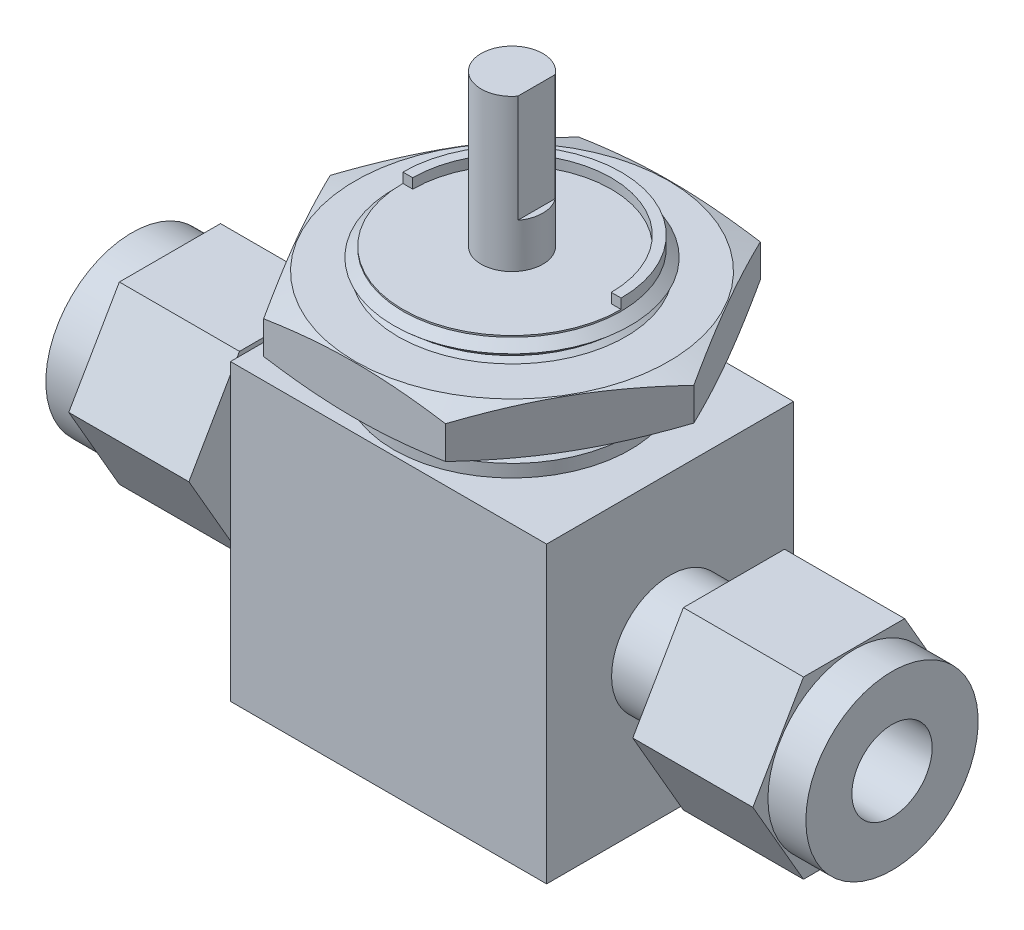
from build123d import *

# Parameters (mm, degrees)
BODY_DEPTH          = 9.9187
BODY_DEPTH_BACK     = 9.9187
SKETCH1_W           = 25.4
SKETCH1_H           = 23.6474
SKETCH2_R           = 4.699
BOSS_DEPTH          = 5.1308
HEX_2_DEPTH         = 9.652
SKETCH4_R           = 6.9215
BOSS_EXTRUDE3_DEPTH = 3.048
SKETCH5_R           = 3.2258
TUBEBORE_DEPTH      = 15.2908
SKETCH6_R           = 9.4996
PACKINGBOSS_DEPTH   = 9.398
BOSS_EXTRUDE4_START = 0.79375
BOSS_EXTRUDE4_DEPTH = 0.79375
SKETCH16_R          = 2.4765
BOSS_EXTRUDE5_DEPTH = 12.192
SKETCH17_W          = 3.302839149
SKETCH17_H          = 11.315815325
CUT_EXTRUDE1_DEPTH  = 8.636
SKETCH12_R          = 2.3749
HOLE_DEPTH          = 71.309138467
HEX_START           = -1.5875
SKETCH18_R          = 9.0678
HEX_NUT_DEPTH       = 3.9116


with BuildPart() as part:
    # Sketch1 → Body (new, two sides: drawn at the far end of the back side and taken through both)
    with BuildSketch(Plane.XY.offset(-BODY_DEPTH_BACK)):
        Rectangle(SKETCH1_W, SKETCH1_H)
    extrude(amount=BODY_DEPTH + BODY_DEPTH_BACK)

    # Sketch2 → Boss (add)
    with BuildSketch(Plane(origin=(12.7, 0, 0), x_dir=(0, 0, -1), z_dir=(1, 0, 0))):
        with Locations(Location((0, 0, 0), (0, 0, 180))):
            Circle(SKETCH2_R)
    boss = extrude(amount=BOSS_DEPTH)

    # Sketch3 → Hex 2 (add)
    with BuildSketch(Plane(origin=(17.8308, 0, 0), x_dir=(0, 0, -1), z_dir=(1, 0, 0))):
        Polygon((-4.064, 7.039054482), (4.064, 7.039054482), (8.128, 0), (4.064, -7.039054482), (-4.064, -7.039054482), (-8.128, 0), align=None)
    hex_2 = extrude(amount=HEX_2_DEPTH)

    # Sketch4 → Boss-Extrude3 (add)
    with BuildSketch(Plane(origin=(27.4828, 0, 0), x_dir=(0, 0, -1), z_dir=(1, 0, 0))):
        with Locations(Location((0, 0, 0), (0, 0, 180))):
            Circle(SKETCH4_R)
    boss_extrude3 = extrude(amount=BOSS_EXTRUDE3_DEPTH)

    # Sketch5 → TubeBore (cut)
    with BuildSketch(Plane(origin=(30.5308, 0, 0), x_dir=(0, 0, -1), z_dir=(1, 0, 0))):
        Circle(SKETCH5_R)
    tubebore = extrude(amount=-TUBEBORE_DEPTH, mode=Mode.SUBTRACT)

    # Mirror1: Boss, Hex 2, Boss-Extrude3, TubeBore across plane
    add(boss.mirror(Plane(origin=(0, 0, 0), x_dir=(0, 0, 1), z_dir=(1, 0, 0))))
    add(hex_2.mirror(Plane(origin=(0, 0, 0), x_dir=(0, 0, 1), z_dir=(1, 0, 0))))
    add(boss_extrude3.mirror(Plane(origin=(0, 0, 0), x_dir=(0, 0, 1), z_dir=(1, 0, 0))))
    add(tubebore.mirror(Plane(origin=(0, 0, 0), x_dir=(0, 0, 1), z_dir=(1, 0, 0))), mode=Mode.SUBTRACT)

    # Sketch6 → PackingBoss (add)
    with BuildSketch(Plane(origin=(0, 11.8237, 0), x_dir=(-1, 0, 0), z_dir=(0, 1, 0))):
        with Locations(Location((0, 0, 0), (0, 0, 90))):
            Circle(SKETCH6_R)
    extrude(amount=PACKINGBOSS_DEPTH)

    # Sketch14 → 3_4-20 unef (revolve, cut)
    with BuildSketch(Plane.XY, mode=Mode.PRIVATE) as f_3_4_20_unef_sk:
        Polygon((9.4996, 12.8397), (8.76935, 13.4747), (9.4996, 14.1097), (8.76935, 14.7447), (9.4996, 15.3797), (8.76935, 16.0147), (9.4996, 16.6497), (8.76935, 17.2847), (9.4996, 17.9197), (8.76935, 18.5547), (9.4996, 19.1897), (8.76935, 19.8247), (9.4996, 20.4597), (8.76935, 21.0947), (8.76935, 22.3647), (10.070312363, 22.3647), (10.070312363, 12.8397), align=None)
    revolve(f_3_4_20_unef_sk.sketch.rotate(Axis((0, 0, 0), (0, 1, 0)), 90), axis=Axis((0, 0, 0), (0, 1, 0)), mode=Mode.SUBTRACT)

    # Sketch7 → Boss-Extrude4 (add)
    with BuildSketch(Plane(origin=(0, 21.2217, 0), x_dir=(-1, 0, 0), z_dir=(0, 1, 0)).offset(BOSS_EXTRUDE4_START)):
        with BuildLine():
            Line((-7.9756, 0), (-8.76935, 0))
            ThreePointArc((-8.76935, 0), (0, -8.76935), (8.76935, 0))
            Line((8.76935, 0), (7.9756, 0))
            ThreePointArc((7.9756, 0), (0, -7.9756), (-7.9756, 0))
        make_face()
    extrude(amount=-BOSS_EXTRUDE4_DEPTH)

    # Sketch16 → Boss-Extrude5 (add)
    with BuildSketch(Plane(origin=(0, 21.2217, 0), x_dir=(1, 0, 0), z_dir=(0, 1, 0))):
        with Locations(Location((0, 0, 0), (0, 0, 90))):
            Circle(SKETCH16_R)
    extrude(amount=BOSS_EXTRUDE5_DEPTH)

    # Sketch17 → Cut-Extrude1 (cut)
    with BuildSketch(Plane(origin=(0, 33.4137, 0), x_dir=(1, 0, 0), z_dir=(0, 1, 0))):
        with Locations((3.619919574, 1.205491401)):
            Rectangle(SKETCH17_W, SKETCH17_H)
    extrude(amount=-CUT_EXTRUDE1_DEPTH, mode=Mode.SUBTRACT)

    # Sketch12 → Hole (cut, through all)
    with BuildSketch(Plane(origin=(30.5308, 0, 0), x_dir=(0, 0, -1), z_dir=(1, 0, 0))):
        Circle(SKETCH12_R)
    extrude(amount=-HOLE_DEPTH, mode=Mode.SUBTRACT)

    # Sketch18 → Hex Nut (add)
    with BuildSketch(Plane(origin=(0, 21.091807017, 0), x_dir=(-1, 0, 0), z_dir=(0, 1, 0)).offset(HEX_START)):
        Polygon((-14.60603805, 0), (-7.303019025, -12.6492), (7.303019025, -12.6492), (14.60603805, 0), (7.303019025, 12.6492), (-7.303019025, 12.6492), align=None)
        with Locations(Location((0, 0, 0), (0, 0, 90))):
            Circle(SKETCH18_R, mode=Mode.SUBTRACT)
    extrude(amount=-HEX_NUT_DEPTH)

    # Sketch19 → Cut-Revolve1 (revolve, cut)
    with BuildSketch(Plane.XY, mode=Mode.PRIVATE) as cut_revolve1_sk:
        Polygon((14.60603805, 18.863782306), (12.584836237, 19.504307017), (14.60603805, 19.504307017), align=None)
        Polygon((14.60603805, 16.233231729), (12.584836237, 15.592707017), (14.60603805, 15.592707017), align=None)
    revolve(cut_revolve1_sk.sketch.rotate(Axis((0, 0, 0), (0, 1, 0)), 299.999999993), axis=Axis((0, 0, 0), (0, 1, 0)), mode=Mode.SUBTRACT)


solid = part.part
